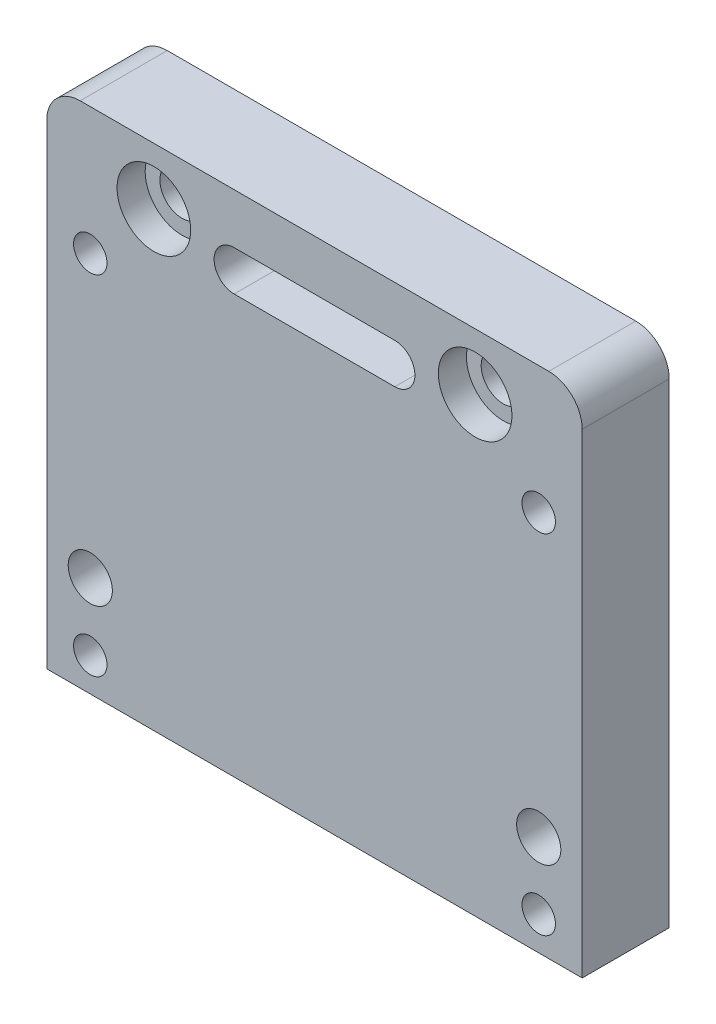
ISO-10303-21;
HEADER;
FILE_DESCRIPTION(('STEP AP214'),'2;1');
FILE_NAME('part.step','',(''),(''),'','','');
FILE_SCHEMA(('AUTOMOTIVE_DESIGN { 1 0 10303 214 1 1 1 1 }'));
ENDSEC;
DATA;
#1=APPLICATION_CONTEXT('core data for automotive mechanical design processes');
#2=APPLICATION_PROTOCOL_DEFINITION('international standard','automotive_design',2000,#1);
#3=PRODUCT_CONTEXT('',#1,'mechanical');
#4=PRODUCT('Part','Part','',(#3));
#5=PRODUCT_RELATED_PRODUCT_CATEGORY('part','',(#4));
#6=PRODUCT_DEFINITION_FORMATION('','',#4);
#7=PRODUCT_DEFINITION_CONTEXT('part definition',#1,'design');
#8=PRODUCT_DEFINITION('design','',#6,#7);
#9=PRODUCT_DEFINITION_SHAPE('','',#8);
#10=(LENGTH_UNIT() NAMED_UNIT(*) SI_UNIT(.MILLI.,.METRE.));
#11=(NAMED_UNIT(*) PLANE_ANGLE_UNIT() SI_UNIT($,.RADIAN.));
#12=(NAMED_UNIT(*) SI_UNIT($,.STERADIAN.) SOLID_ANGLE_UNIT());
#13=UNCERTAINTY_MEASURE_WITH_UNIT(LENGTH_MEASURE(1.E-05),#10,'distance_accuracy_value','');
#14=(GEOMETRIC_REPRESENTATION_CONTEXT(3) GLOBAL_UNCERTAINTY_ASSIGNED_CONTEXT((#13)) GLOBAL_UNIT_ASSIGNED_CONTEXT((#10,
#11,#12)) REPRESENTATION_CONTEXT('',''));
#15=CARTESIAN_POINT('',(0.,0.,0.));
#16=DIRECTION('',(0.,0.,1.));
#17=DIRECTION('',(1.,0.,0.));
#18=AXIS2_PLACEMENT_3D('',#15,#16,#17);
#19=CARTESIAN_POINT('',(-40.,0.,0.));
#20=DIRECTION('',(0.,0.,-1.));
#21=DIRECTION('',(-1.,0.,0.));
#22=AXIS2_PLACEMENT_3D('',#19,#20,#21);
#23=PLANE('',#22);
#24=CARTESIAN_POINT('',(-33.5,57.,0.));
#25=DIRECTION('',(0.,0.,1.));
#26=DIRECTION('',(1.,0.,0.));
#27=AXIS2_PLACEMENT_3D('',#24,#25,#26);
#28=CIRCLE('',#27,2.5);
#29=CARTESIAN_POINT('',(-31.,57.,0.));
#30=VERTEX_POINT('',#29);
#31=EDGE_CURVE('E556',#30,#30,#28,.T.);
#32=ORIENTED_EDGE('',*,*,#31,.T.);
#33=EDGE_LOOP('',(#32));
#34=FACE_BOUND('',#33,.T.);
#35=CARTESIAN_POINT('',(-33.5,5.,0.));
#36=DIRECTION('',(0.,0.,1.));
#37=DIRECTION('',(1.,0.,0.));
#38=AXIS2_PLACEMENT_3D('',#35,#36,#37);
#39=CIRCLE('',#38,2.5);
#40=CARTESIAN_POINT('',(-31.,5.,0.));
#41=VERTEX_POINT('',#40);
#42=EDGE_CURVE('E560',#41,#41,#39,.T.);
#43=ORIENTED_EDGE('',*,*,#42,.T.);
#44=EDGE_LOOP('',(#43));
#45=FACE_BOUND('',#44,.T.);
#46=CARTESIAN_POINT('',(33.5,5.,0.));
#47=DIRECTION('',(0.,0.,1.));
#48=DIRECTION('',(1.,0.,0.));
#49=AXIS2_PLACEMENT_3D('',#46,#47,#48);
#50=CIRCLE('',#49,2.5);
#51=CARTESIAN_POINT('',(36.,5.,0.));
#52=VERTEX_POINT('',#51);
#53=EDGE_CURVE('E569',#52,#52,#50,.T.);
#54=ORIENTED_EDGE('',*,*,#53,.T.);
#55=EDGE_LOOP('',(#54));
#56=FACE_BOUND('',#55,.T.);
#57=DIRECTION('',(-1.,0.,0.));
#58=VECTOR('',#57,1.);
#59=CARTESIAN_POINT('',(-40.,76.,0.));
#60=LINE('',#59,#58);
#61=CARTESIAN_POINT('',(35.,76.,0.));
#62=VERTEX_POINT('',#61);
#63=CARTESIAN_POINT('',(-35.,76.,0.));
#64=VERTEX_POINT('',#63);
#65=EDGE_CURVE('E208',#62,#64,#60,.T.);
#66=ORIENTED_EDGE('',*,*,#65,.F.);
#67=CARTESIAN_POINT('',(35.,71.,0.));
#68=DIRECTION('',(0.,0.,-1.));
#69=DIRECTION('',(-1.,0.,0.));
#70=AXIS2_PLACEMENT_3D('',#67,#68,#69);
#71=CIRCLE('',#70,5.);
#72=CARTESIAN_POINT('',(40.,71.,0.));
#73=VERTEX_POINT('',#72);
#74=EDGE_CURVE('E237',#62,#73,#71,.T.);
#75=ORIENTED_EDGE('',*,*,#74,.T.);
#76=DIRECTION('',(0.,1.,0.));
#77=VECTOR('',#76,1.);
#78=CARTESIAN_POINT('',(40.,0.,0.));
#79=LINE('',#78,#77);
#80=CARTESIAN_POINT('',(40.,0.,0.));
#81=VERTEX_POINT('',#80);
#82=EDGE_CURVE('E220',#81,#73,#79,.T.);
#83=ORIENTED_EDGE('',*,*,#82,.F.);
#84=DIRECTION('',(1.,0.,0.));
#85=VECTOR('',#84,1.);
#86=CARTESIAN_POINT('',(-40.,0.,0.));
#87=LINE('',#86,#85);
#88=CARTESIAN_POINT('',(-40.,0.,0.));
#89=VERTEX_POINT('',#88);
#90=EDGE_CURVE('E218',#89,#81,#87,.T.);
#91=ORIENTED_EDGE('',*,*,#90,.F.);
#92=DIRECTION('',(0.,-1.,0.));
#93=VECTOR('',#92,1.);
#94=CARTESIAN_POINT('',(-40.,0.,0.));
#95=LINE('',#94,#93);
#96=CARTESIAN_POINT('',(-40.,71.,0.));
#97=VERTEX_POINT('',#96);
#98=EDGE_CURVE('E204',#97,#89,#95,.T.);
#99=ORIENTED_EDGE('',*,*,#98,.F.);
#100=CARTESIAN_POINT('',(-35.,71.,0.));
#101=DIRECTION('',(0.,0.,-1.));
#102=DIRECTION('',(-1.,0.,0.));
#103=AXIS2_PLACEMENT_3D('',#100,#101,#102);
#104=CIRCLE('',#103,5.);
#105=EDGE_CURVE('E235',#97,#64,#104,.T.);
#106=ORIENTED_EDGE('',*,*,#105,.T.);
#107=EDGE_LOOP('',(#66,#75,#83,#91,#99,#106));
#108=FACE_BOUND('',#107,.T.);
#109=CARTESIAN_POINT('',(33.5,15.,0.));
#110=DIRECTION('',(0.,0.,-1.));
#111=DIRECTION('',(-1.,0.,0.));
#112=AXIS2_PLACEMENT_3D('',#109,#110,#111);
#113=CIRCLE('',#112,5.49999999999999);
#114=CARTESIAN_POINT('',(28.,15.,0.));
#115=VERTEX_POINT('',#114);
#116=EDGE_CURVE('E192',#115,#115,#113,.T.);
#117=ORIENTED_EDGE('',*,*,#116,.F.);
#118=EDGE_LOOP('',(#117));
#119=FACE_BOUND('',#118,.T.);
#120=CARTESIAN_POINT('',(-33.5,15.,0.));
#121=DIRECTION('',(0.,0.,-1.));
#122=DIRECTION('',(-1.,0.,0.));
#123=AXIS2_PLACEMENT_3D('',#120,#121,#122);
#124=CIRCLE('',#123,5.49999999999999);
#125=CARTESIAN_POINT('',(-39.,15.,0.));
#126=VERTEX_POINT('',#125);
#127=EDGE_CURVE('E180',#126,#126,#124,.T.);
#128=ORIENTED_EDGE('',*,*,#127,.F.);
#129=EDGE_LOOP('',(#128));
#130=FACE_BOUND('',#129,.T.);
#131=CARTESIAN_POINT('',(24.,67.5,0.));
#132=DIRECTION('',(0.,0.,-1.));
#133=DIRECTION('',(-1.,0.,0.));
#134=AXIS2_PLACEMENT_3D('',#131,#132,#133);
#135=CIRCLE('',#134,5.49999999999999);
#136=CARTESIAN_POINT('',(18.5,67.5,0.));
#137=VERTEX_POINT('',#136);
#138=EDGE_CURVE('E171',#137,#137,#135,.T.);
#139=ORIENTED_EDGE('',*,*,#138,.F.);
#140=EDGE_LOOP('',(#139));
#141=FACE_BOUND('',#140,.T.);
#142=CARTESIAN_POINT('',(-24.,67.5,0.));
#143=DIRECTION('',(0.,0.,-1.));
#144=DIRECTION('',(-1.,0.,0.));
#145=AXIS2_PLACEMENT_3D('',#142,#143,#144);
#146=CIRCLE('',#145,5.49999999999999);
#147=CARTESIAN_POINT('',(-29.5,67.5,0.));
#148=VERTEX_POINT('',#147);
#149=EDGE_CURVE('E162',#148,#148,#146,.T.);
#150=ORIENTED_EDGE('',*,*,#149,.F.);
#151=EDGE_LOOP('',(#150));
#152=FACE_BOUND('',#151,.T.);
#153=CARTESIAN_POINT('',(-12.,65.5,0.));
#154=DIRECTION('',(0.,0.,1.));
#155=DIRECTION('',(-1.,0.,0.));
#156=AXIS2_PLACEMENT_3D('',#153,#154,#155);
#157=CIRCLE('',#156,3.);
#158=CARTESIAN_POINT('',(-12.,68.5,0.));
#159=VERTEX_POINT('',#158);
#160=CARTESIAN_POINT('',(-12.,62.5,0.));
#161=VERTEX_POINT('',#160);
#162=EDGE_CURVE('E113',#159,#161,#157,.T.);
#163=ORIENTED_EDGE('',*,*,#162,.T.);
#164=DIRECTION('',(1.,0.,0.));
#165=VECTOR('',#164,1.);
#166=CARTESIAN_POINT('',(-12.,62.5,0.));
#167=LINE('',#166,#165);
#168=CARTESIAN_POINT('',(12.,62.5,0.));
#169=VERTEX_POINT('',#168);
#170=EDGE_CURVE('E122',#161,#169,#167,.T.);
#171=ORIENTED_EDGE('',*,*,#170,.T.);
#172=CARTESIAN_POINT('',(12.,65.5,0.));
#173=DIRECTION('',(0.,0.,1.));
#174=DIRECTION('',(1.,0.,0.));
#175=AXIS2_PLACEMENT_3D('',#172,#173,#174);
#176=CIRCLE('',#175,3.);
#177=CARTESIAN_POINT('',(12.,68.5,0.));
#178=VERTEX_POINT('',#177);
#179=EDGE_CURVE('E57',#169,#178,#176,.T.);
#180=ORIENTED_EDGE('',*,*,#179,.T.);
#181=DIRECTION('',(-1.,0.,0.));
#182=VECTOR('',#181,1.);
#183=CARTESIAN_POINT('',(-12.,68.5,0.));
#184=LINE('',#183,#182);
#185=EDGE_CURVE('E119',#178,#159,#184,.T.);
#186=ORIENTED_EDGE('',*,*,#185,.T.);
#187=EDGE_LOOP('',(#163,#171,#180,#186));
#188=FACE_BOUND('',#187,.T.);
#189=CARTESIAN_POINT('',(33.5,57.,0.));
#190=DIRECTION('',(0.,0.,1.));
#191=DIRECTION('',(1.,0.,0.));
#192=AXIS2_PLACEMENT_3D('',#189,#190,#191);
#193=CIRCLE('',#192,2.5);
#194=CARTESIAN_POINT('',(36.,57.,0.));
#195=VERTEX_POINT('',#194);
#196=EDGE_CURVE('E574',#195,#195,#193,.T.);
#197=ORIENTED_EDGE('',*,*,#196,.T.);
#198=EDGE_LOOP('',(#197));
#199=FACE_BOUND('',#198,.T.);
#200=ADVANCED_FACE('F32',(#34,#45,#56,#108,#119,#130,#141,#152,#188,#199),#23,.T.);
#201=CARTESIAN_POINT('',(-40.,0.,13.));
#202=DIRECTION('',(0.,0.,-1.));
#203=DIRECTION('',(-1.,0.,0.));
#204=AXIS2_PLACEMENT_3D('',#201,#202,#203);
#205=PLANE('',#204);
#206=CARTESIAN_POINT('',(-33.5,57.,13.));
#207=DIRECTION('',(0.,0.,1.));
#208=DIRECTION('',(1.,0.,0.));
#209=AXIS2_PLACEMENT_3D('',#206,#207,#208);
#210=CIRCLE('',#209,2.49999999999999);
#211=CARTESIAN_POINT('',(-31.,57.,13.));
#212=VERTEX_POINT('',#211);
#213=EDGE_CURVE('E559',#212,#212,#210,.T.);
#214=ORIENTED_EDGE('',*,*,#213,.F.);
#215=EDGE_LOOP('',(#214));
#216=FACE_BOUND('',#215,.T.);
#217=CARTESIAN_POINT('',(-33.5,5.,13.));
#218=DIRECTION('',(0.,0.,1.));
#219=DIRECTION('',(1.,0.,0.));
#220=AXIS2_PLACEMENT_3D('',#217,#218,#219);
#221=CIRCLE('',#220,2.49999999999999);
#222=CARTESIAN_POINT('',(-31.,5.,13.));
#223=VERTEX_POINT('',#222);
#224=EDGE_CURVE('E563',#223,#223,#221,.T.);
#225=ORIENTED_EDGE('',*,*,#224,.F.);
#226=EDGE_LOOP('',(#225));
#227=FACE_BOUND('',#226,.T.);
#228=CARTESIAN_POINT('',(33.5,5.,13.));
#229=DIRECTION('',(0.,0.,1.));
#230=DIRECTION('',(1.,0.,0.));
#231=AXIS2_PLACEMENT_3D('',#228,#229,#230);
#232=CIRCLE('',#231,2.49999999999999);
#233=CARTESIAN_POINT('',(36.,5.,13.));
#234=VERTEX_POINT('',#233);
#235=EDGE_CURVE('E572',#234,#234,#232,.T.);
#236=ORIENTED_EDGE('',*,*,#235,.F.);
#237=EDGE_LOOP('',(#236));
#238=FACE_BOUND('',#237,.T.);
#239=CARTESIAN_POINT('',(33.5,57.,13.));
#240=DIRECTION('',(0.,0.,1.));
#241=DIRECTION('',(1.,0.,0.));
#242=AXIS2_PLACEMENT_3D('',#239,#240,#241);
#243=CIRCLE('',#242,2.49999999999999);
#244=CARTESIAN_POINT('',(36.,57.,13.));
#245=VERTEX_POINT('',#244);
#246=EDGE_CURVE('E134',#245,#245,#243,.T.);
#247=ORIENTED_EDGE('',*,*,#246,.F.);
#248=EDGE_LOOP('',(#247));
#249=FACE_BOUND('',#248,.T.);
#250=DIRECTION('',(1.,0.,0.));
#251=VECTOR('',#250,1.);
#252=CARTESIAN_POINT('',(-12.,62.5,13.));
#253=LINE('',#252,#251);
#254=CARTESIAN_POINT('',(-12.,62.5,13.));
#255=VERTEX_POINT('',#254);
#256=CARTESIAN_POINT('',(12.,62.5,13.));
#257=VERTEX_POINT('',#256);
#258=EDGE_CURVE('E140',#255,#257,#253,.T.);
#259=ORIENTED_EDGE('',*,*,#258,.F.);
#260=CARTESIAN_POINT('',(-12.,65.5,13.));
#261=DIRECTION('',(0.,0.,1.));
#262=DIRECTION('',(-1.,0.,0.));
#263=AXIS2_PLACEMENT_3D('',#260,#261,#262);
#264=CIRCLE('',#263,3.);
#265=CARTESIAN_POINT('',(-12.,68.5,13.));
#266=VERTEX_POINT('',#265);
#267=EDGE_CURVE('E49',#266,#255,#264,.T.);
#268=ORIENTED_EDGE('',*,*,#267,.F.);
#269=DIRECTION('',(-1.,0.,0.));
#270=VECTOR('',#269,1.);
#271=CARTESIAN_POINT('',(-12.,68.5,13.));
#272=LINE('',#271,#270);
#273=CARTESIAN_POINT('',(12.,68.5,13.));
#274=VERTEX_POINT('',#273);
#275=EDGE_CURVE('E128',#274,#266,#272,.T.);
#276=ORIENTED_EDGE('',*,*,#275,.F.);
#277=CARTESIAN_POINT('',(12.,65.5,13.));
#278=DIRECTION('',(0.,0.,1.));
#279=DIRECTION('',(1.,0.,0.));
#280=AXIS2_PLACEMENT_3D('',#277,#278,#279);
#281=CIRCLE('',#280,3.);
#282=EDGE_CURVE('E131',#257,#274,#281,.T.);
#283=ORIENTED_EDGE('',*,*,#282,.F.);
#284=EDGE_LOOP('',(#259,#268,#276,#283));
#285=FACE_BOUND('',#284,.T.);
#286=CARTESIAN_POINT('',(-24.,67.5,13.));
#287=DIRECTION('',(0.,0.,-1.));
#288=DIRECTION('',(-1.,0.,0.));
#289=AXIS2_PLACEMENT_3D('',#286,#287,#288);
#290=CIRCLE('',#289,5.5);
#291=CARTESIAN_POINT('',(-29.5,67.5,13.));
#292=VERTEX_POINT('',#291);
#293=EDGE_CURVE('E159',#292,#292,#290,.T.);
#294=ORIENTED_EDGE('',*,*,#293,.T.);
#295=EDGE_LOOP('',(#294));
#296=FACE_BOUND('',#295,.T.);
#297=CARTESIAN_POINT('',(-33.5,15.,13.));
#298=DIRECTION('',(0.,0.,-1.));
#299=DIRECTION('',(-1.,0.,0.));
#300=AXIS2_PLACEMENT_3D('',#297,#298,#299);
#301=CIRCLE('',#300,3.3);
#302=CARTESIAN_POINT('',(-36.8,15.,13.));
#303=VERTEX_POINT('',#302);
#304=EDGE_CURVE('E189',#303,#303,#301,.T.);
#305=ORIENTED_EDGE('',*,*,#304,.T.);
#306=EDGE_LOOP('',(#305));
#307=FACE_BOUND('',#306,.T.);
#308=CARTESIAN_POINT('',(33.5,15.,13.));
#309=DIRECTION('',(0.,0.,-1.));
#310=DIRECTION('',(-1.,0.,0.));
#311=AXIS2_PLACEMENT_3D('',#308,#309,#310);
#312=CIRCLE('',#311,3.3);
#313=CARTESIAN_POINT('',(30.2,15.,13.));
#314=VERTEX_POINT('',#313);
#315=EDGE_CURVE('E201',#314,#314,#312,.T.);
#316=ORIENTED_EDGE('',*,*,#315,.T.);
#317=EDGE_LOOP('',(#316));
#318=FACE_BOUND('',#317,.T.);
#319=DIRECTION('',(0.,1.,0.));
#320=VECTOR('',#319,1.);
#321=CARTESIAN_POINT('',(40.,0.,13.));
#322=LINE('',#321,#320);
#323=CARTESIAN_POINT('',(40.,0.,13.));
#324=VERTEX_POINT('',#323);
#325=CARTESIAN_POINT('',(40.,71.,13.));
#326=VERTEX_POINT('',#325);
#327=EDGE_CURVE('E210',#324,#326,#322,.T.);
#328=ORIENTED_EDGE('',*,*,#327,.T.);
#329=CARTESIAN_POINT('',(35.,71.,13.));
#330=DIRECTION('',(0.,0.,-1.));
#331=DIRECTION('',(-1.,0.,0.));
#332=AXIS2_PLACEMENT_3D('',#329,#330,#331);
#333=CIRCLE('',#332,5.);
#334=CARTESIAN_POINT('',(35.,76.,13.));
#335=VERTEX_POINT('',#334);
#336=EDGE_CURVE('E41',#326,#335,#333,.F.);
#337=ORIENTED_EDGE('',*,*,#336,.T.);
#338=DIRECTION('',(-1.,0.,0.));
#339=VECTOR('',#338,1.);
#340=CARTESIAN_POINT('',(-40.,76.,13.));
#341=LINE('',#340,#339);
#342=CARTESIAN_POINT('',(-35.,76.,13.));
#343=VERTEX_POINT('',#342);
#344=EDGE_CURVE('E213',#335,#343,#341,.T.);
#345=ORIENTED_EDGE('',*,*,#344,.T.);
#346=CARTESIAN_POINT('',(-35.,71.,13.));
#347=DIRECTION('',(0.,0.,-1.));
#348=DIRECTION('',(-1.,0.,0.));
#349=AXIS2_PLACEMENT_3D('',#346,#347,#348);
#350=CIRCLE('',#349,5.);
#351=CARTESIAN_POINT('',(-40.,71.,13.));
#352=VERTEX_POINT('',#351);
#353=EDGE_CURVE('E241',#343,#352,#350,.F.);
#354=ORIENTED_EDGE('',*,*,#353,.T.);
#355=DIRECTION('',(0.,-1.,0.));
#356=VECTOR('',#355,1.);
#357=CARTESIAN_POINT('',(-40.,0.,13.));
#358=LINE('',#357,#356);
#359=CARTESIAN_POINT('',(-40.,0.,13.));
#360=VERTEX_POINT('',#359);
#361=EDGE_CURVE('E205',#352,#360,#358,.T.);
#362=ORIENTED_EDGE('',*,*,#361,.T.);
#363=DIRECTION('',(1.,0.,0.));
#364=VECTOR('',#363,1.);
#365=CARTESIAN_POINT('',(-40.,0.,13.));
#366=LINE('',#365,#364);
#367=EDGE_CURVE('E207',#360,#324,#366,.T.);
#368=ORIENTED_EDGE('',*,*,#367,.T.);
#369=EDGE_LOOP('',(#328,#337,#345,#354,#362,#368));
#370=FACE_BOUND('',#369,.T.);
#371=CARTESIAN_POINT('',(24.,67.5,13.));
#372=DIRECTION('',(0.,0.,-1.));
#373=DIRECTION('',(1.,0.,0.));
#374=AXIS2_PLACEMENT_3D('',#371,#372,#373);
#375=CIRCLE('',#374,5.5);
#376=CARTESIAN_POINT('',(29.5,67.5,13.));
#377=VERTEX_POINT('',#376);
#378=EDGE_CURVE('E146',#377,#377,#375,.T.);
#379=ORIENTED_EDGE('',*,*,#378,.T.);
#380=EDGE_LOOP('',(#379));
#381=FACE_BOUND('',#380,.T.);
#382=ADVANCED_FACE('F268',(#216,#227,#238,#249,#285,#296,#307,#318,#370,#381),#205,.F.);
#383=CARTESIAN_POINT('',(24.,67.5,0.));
#384=DIRECTION('',(0.,0.,-1.));
#385=DIRECTION('',(-1.,0.,0.));
#386=AXIS2_PLACEMENT_3D('',#383,#384,#385);
#387=CYLINDRICAL_SURFACE('',#386,3.3);
#388=CARTESIAN_POINT('',(24.,67.5,4.2));
#389=DIRECTION('',(0.,0.,-1.));
#390=DIRECTION('',(-1.,0.,0.));
#391=AXIS2_PLACEMENT_3D('',#388,#389,#390);
#392=CIRCLE('',#391,3.3);
#393=CARTESIAN_POINT('',(20.7,67.5,4.2));
#394=VERTEX_POINT('',#393);
#395=EDGE_CURVE('E177',#394,#394,#392,.T.);
#396=ORIENTED_EDGE('',*,*,#395,.T.);
#397=EDGE_LOOP('',(#396));
#398=FACE_BOUND('',#397,.T.);
#399=CARTESIAN_POINT('',(24.,67.5,8.8));
#400=DIRECTION('',(0.,0.,1.));
#401=DIRECTION('',(1.,0.,0.));
#402=AXIS2_PLACEMENT_3D('',#399,#400,#401);
#403=CIRCLE('',#402,3.3);
#404=CARTESIAN_POINT('',(27.3,67.5,8.8));
#405=VERTEX_POINT('',#404);
#406=EDGE_CURVE('E36',#405,#405,#403,.F.);
#407=ORIENTED_EDGE('',*,*,#406,.F.);
#408=EDGE_LOOP('',(#407));
#409=FACE_BOUND('',#408,.T.);
#410=ADVANCED_FACE('F274',(#398,#409),#387,.F.);
#411=CARTESIAN_POINT('',(-40.,0.,13.));
#412=DIRECTION('',(1.,0.,0.));
#413=DIRECTION('',(0.,0.,-1.));
#414=AXIS2_PLACEMENT_3D('',#411,#412,#413);
#415=PLANE('',#414);
#416=ORIENTED_EDGE('',*,*,#361,.F.);
#417=DIRECTION('',(0.,0.,-1.));
#418=VECTOR('',#417,1.);
#419=CARTESIAN_POINT('',(-40.,71.,13.));
#420=LINE('',#419,#418);
#421=EDGE_CURVE('E11',#352,#97,#420,.T.);
#422=ORIENTED_EDGE('',*,*,#421,.T.);
#423=ORIENTED_EDGE('',*,*,#98,.T.);
#424=DIRECTION('',(0.,0.,-1.));
#425=VECTOR('',#424,1.);
#426=CARTESIAN_POINT('',(-40.,0.,13.));
#427=LINE('',#426,#425);
#428=EDGE_CURVE('E227',#360,#89,#427,.T.);
#429=ORIENTED_EDGE('',*,*,#428,.F.);
#430=EDGE_LOOP('',(#416,#422,#423,#429));
#431=FACE_BOUND('',#430,.T.);
#432=ADVANCED_FACE('F293',(#431),#415,.F.);
#433=CARTESIAN_POINT('',(-40.,0.,13.));
#434=DIRECTION('',(0.,1.,0.));
#435=DIRECTION('',(0.,0.,1.));
#436=AXIS2_PLACEMENT_3D('',#433,#434,#435);
#437=PLANE('',#436);
#438=ORIENTED_EDGE('',*,*,#90,.T.);
#439=DIRECTION('',(0.,0.,-1.));
#440=VECTOR('',#439,1.);
#441=CARTESIAN_POINT('',(40.,0.,13.));
#442=LINE('',#441,#440);
#443=EDGE_CURVE('E216',#324,#81,#442,.T.);
#444=ORIENTED_EDGE('',*,*,#443,.F.);
#445=ORIENTED_EDGE('',*,*,#367,.F.);
#446=ORIENTED_EDGE('',*,*,#428,.T.);
#447=EDGE_LOOP('',(#438,#444,#445,#446));
#448=FACE_BOUND('',#447,.T.);
#449=ADVANCED_FACE('F289',(#448),#437,.F.);
#450=CARTESIAN_POINT('',(40.,0.,13.));
#451=DIRECTION('',(-1.,0.,0.));
#452=DIRECTION('',(0.,0.,1.));
#453=AXIS2_PLACEMENT_3D('',#450,#451,#452);
#454=PLANE('',#453);
#455=ORIENTED_EDGE('',*,*,#82,.T.);
#456=DIRECTION('',(0.,0.,-1.));
#457=VECTOR('',#456,1.);
#458=CARTESIAN_POINT('',(40.,71.,13.));
#459=LINE('',#458,#457);
#460=EDGE_CURVE('E239',#73,#326,#459,.F.);
#461=ORIENTED_EDGE('',*,*,#460,.T.);
#462=ORIENTED_EDGE('',*,*,#327,.F.);
#463=ORIENTED_EDGE('',*,*,#443,.T.);
#464=EDGE_LOOP('',(#455,#461,#462,#463));
#465=FACE_BOUND('',#464,.T.);
#466=ADVANCED_FACE('F285',(#465),#454,.F.);
#467=CARTESIAN_POINT('',(-40.,76.,13.));
#468=DIRECTION('',(0.,-1.,0.));
#469=DIRECTION('',(1.,0.,0.));
#470=AXIS2_PLACEMENT_3D('',#467,#468,#469);
#471=PLANE('',#470);
#472=ORIENTED_EDGE('',*,*,#344,.F.);
#473=DIRECTION('',(0.,0.,-1.));
#474=VECTOR('',#473,1.);
#475=CARTESIAN_POINT('',(35.,76.,13.));
#476=LINE('',#475,#474);
#477=EDGE_CURVE('E232',#335,#62,#476,.T.);
#478=ORIENTED_EDGE('',*,*,#477,.T.);
#479=ORIENTED_EDGE('',*,*,#65,.T.);
#480=DIRECTION('',(0.,0.,-1.));
#481=VECTOR('',#480,1.);
#482=CARTESIAN_POINT('',(-35.,76.,13.));
#483=LINE('',#482,#481);
#484=EDGE_CURVE('E230',#64,#343,#483,.F.);
#485=ORIENTED_EDGE('',*,*,#484,.T.);
#486=EDGE_LOOP('',(#472,#478,#479,#485));
#487=FACE_BOUND('',#486,.T.);
#488=ADVANCED_FACE('F281',(#487),#471,.F.);
#489=CARTESIAN_POINT('',(35.,71.,13.));
#490=DIRECTION('',(0.,0.,-1.));
#491=DIRECTION('',(-1.,0.,0.));
#492=AXIS2_PLACEMENT_3D('',#489,#490,#491);
#493=CYLINDRICAL_SURFACE('',#492,5.);
#494=ORIENTED_EDGE('',*,*,#336,.F.);
#495=ORIENTED_EDGE('',*,*,#460,.F.);
#496=ORIENTED_EDGE('',*,*,#74,.F.);
#497=ORIENTED_EDGE('',*,*,#477,.F.);
#498=EDGE_LOOP('',(#494,#495,#496,#497));
#499=FACE_BOUND('',#498,.T.);
#500=ADVANCED_FACE('F284',(#499),#493,.T.);
#501=CARTESIAN_POINT('',(-35.,71.,13.));
#502=DIRECTION('',(0.,0.,-1.));
#503=DIRECTION('',(-1.,0.,0.));
#504=AXIS2_PLACEMENT_3D('',#501,#502,#503);
#505=CYLINDRICAL_SURFACE('',#504,5.);
#506=ORIENTED_EDGE('',*,*,#353,.F.);
#507=ORIENTED_EDGE('',*,*,#484,.F.);
#508=ORIENTED_EDGE('',*,*,#105,.F.);
#509=ORIENTED_EDGE('',*,*,#421,.F.);
#510=EDGE_LOOP('',(#506,#507,#508,#509));
#511=FACE_BOUND('',#510,.T.);
#512=ADVANCED_FACE('F34',(#511),#505,.T.);
#513=CARTESIAN_POINT('',(33.5,15.,0.));
#514=DIRECTION('',(0.,0.,-1.));
#515=DIRECTION('',(-1.,0.,0.));
#516=AXIS2_PLACEMENT_3D('',#513,#514,#515);
#517=CYLINDRICAL_SURFACE('',#516,3.3);
#518=ORIENTED_EDGE('',*,*,#315,.F.);
#519=EDGE_LOOP('',(#518));
#520=FACE_BOUND('',#519,.T.);
#521=CARTESIAN_POINT('',(33.5,15.,4.2));
#522=DIRECTION('',(0.,0.,-1.));
#523=DIRECTION('',(-1.,0.,0.));
#524=AXIS2_PLACEMENT_3D('',#521,#522,#523);
#525=CIRCLE('',#524,3.3);
#526=CARTESIAN_POINT('',(30.2,15.,4.2));
#527=VERTEX_POINT('',#526);
#528=EDGE_CURVE('E198',#527,#527,#525,.T.);
#529=ORIENTED_EDGE('',*,*,#528,.T.);
#530=EDGE_LOOP('',(#529));
#531=FACE_BOUND('',#530,.T.);
#532=ADVANCED_FACE('F302',(#520,#531),#517,.F.);
#533=CARTESIAN_POINT('',(36.8,15.,4.2));
#534=DIRECTION('',(0.,0.,1.));
#535=DIRECTION('',(1.,0.,0.));
#536=AXIS2_PLACEMENT_3D('',#533,#534,#535);
#537=PLANE('',#536);
#538=ORIENTED_EDGE('',*,*,#528,.F.);
#539=EDGE_LOOP('',(#538));
#540=FACE_BOUND('',#539,.T.);
#541=CARTESIAN_POINT('',(33.5,15.,4.2));
#542=DIRECTION('',(0.,0.,-1.));
#543=DIRECTION('',(-1.,0.,0.));
#544=AXIS2_PLACEMENT_3D('',#541,#542,#543);
#545=CIRCLE('',#544,5.5);
#546=CARTESIAN_POINT('',(28.,15.,4.2));
#547=VERTEX_POINT('',#546);
#548=EDGE_CURVE('E195',#547,#547,#545,.T.);
#549=ORIENTED_EDGE('',*,*,#548,.T.);
#550=EDGE_LOOP('',(#549));
#551=FACE_BOUND('',#550,.T.);
#552=ADVANCED_FACE('F366',(#540,#551),#537,.F.);
#553=CARTESIAN_POINT('',(33.5,15.,0.));
#554=DIRECTION('',(0.,0.,-1.));
#555=DIRECTION('',(-1.,0.,0.));
#556=AXIS2_PLACEMENT_3D('',#553,#554,#555);
#557=CYLINDRICAL_SURFACE('',#556,5.49999999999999);
#558=ORIENTED_EDGE('',*,*,#548,.F.);
#559=EDGE_LOOP('',(#558));
#560=FACE_BOUND('',#559,.T.);
#561=ORIENTED_EDGE('',*,*,#116,.T.);
#562=EDGE_LOOP('',(#561));
#563=FACE_BOUND('',#562,.T.);
#564=ADVANCED_FACE('F362',(#560,#563),#557,.F.);
#565=CARTESIAN_POINT('',(-33.5,15.,0.));
#566=DIRECTION('',(0.,0.,-1.));
#567=DIRECTION('',(-1.,0.,0.));
#568=AXIS2_PLACEMENT_3D('',#565,#566,#567);
#569=CYLINDRICAL_SURFACE('',#568,3.3);
#570=ORIENTED_EDGE('',*,*,#304,.F.);
#571=EDGE_LOOP('',(#570));
#572=FACE_BOUND('',#571,.T.);
#573=CARTESIAN_POINT('',(-33.5,15.,4.2));
#574=DIRECTION('',(0.,0.,-1.));
#575=DIRECTION('',(-1.,0.,0.));
#576=AXIS2_PLACEMENT_3D('',#573,#574,#575);
#577=CIRCLE('',#576,3.3);
#578=CARTESIAN_POINT('',(-36.8,15.,4.2));
#579=VERTEX_POINT('',#578);
#580=EDGE_CURVE('E186',#579,#579,#577,.T.);
#581=ORIENTED_EDGE('',*,*,#580,.T.);
#582=EDGE_LOOP('',(#581));
#583=FACE_BOUND('',#582,.T.);
#584=ADVANCED_FACE('F358',(#572,#583),#569,.F.);
#585=CARTESIAN_POINT('',(-30.2,15.,4.2));
#586=DIRECTION('',(0.,0.,1.));
#587=DIRECTION('',(1.,0.,0.));
#588=AXIS2_PLACEMENT_3D('',#585,#586,#587);
#589=PLANE('',#588);
#590=ORIENTED_EDGE('',*,*,#580,.F.);
#591=EDGE_LOOP('',(#590));
#592=FACE_BOUND('',#591,.T.);
#593=CARTESIAN_POINT('',(-33.5,15.,4.2));
#594=DIRECTION('',(0.,0.,-1.));
#595=DIRECTION('',(-1.,0.,0.));
#596=AXIS2_PLACEMENT_3D('',#593,#594,#595);
#597=CIRCLE('',#596,5.5);
#598=CARTESIAN_POINT('',(-39.,15.,4.2));
#599=VERTEX_POINT('',#598);
#600=EDGE_CURVE('E183',#599,#599,#597,.T.);
#601=ORIENTED_EDGE('',*,*,#600,.T.);
#602=EDGE_LOOP('',(#601));
#603=FACE_BOUND('',#602,.T.);
#604=ADVANCED_FACE('F354',(#592,#603),#589,.F.);
#605=CARTESIAN_POINT('',(-33.5,15.,0.));
#606=DIRECTION('',(0.,0.,-1.));
#607=DIRECTION('',(-1.,0.,0.));
#608=AXIS2_PLACEMENT_3D('',#605,#606,#607);
#609=CYLINDRICAL_SURFACE('',#608,5.5);
#610=ORIENTED_EDGE('',*,*,#600,.F.);
#611=EDGE_LOOP('',(#610));
#612=FACE_BOUND('',#611,.T.);
#613=ORIENTED_EDGE('',*,*,#127,.T.);
#614=EDGE_LOOP('',(#613));
#615=FACE_BOUND('',#614,.T.);
#616=ADVANCED_FACE('F343',(#612,#615),#609,.F.);
#617=CARTESIAN_POINT('',(27.3,67.5,4.2));
#618=DIRECTION('',(0.,0.,1.));
#619=DIRECTION('',(1.,0.,0.));
#620=AXIS2_PLACEMENT_3D('',#617,#618,#619);
#621=PLANE('',#620);
#622=ORIENTED_EDGE('',*,*,#395,.F.);
#623=EDGE_LOOP('',(#622));
#624=FACE_BOUND('',#623,.T.);
#625=CARTESIAN_POINT('',(24.,67.5,4.2));
#626=DIRECTION('',(0.,0.,-1.));
#627=DIRECTION('',(-1.,0.,0.));
#628=AXIS2_PLACEMENT_3D('',#625,#626,#627);
#629=CIRCLE('',#628,5.5);
#630=CARTESIAN_POINT('',(18.5,67.5,4.2));
#631=VERTEX_POINT('',#630);
#632=EDGE_CURVE('E174',#631,#631,#629,.T.);
#633=ORIENTED_EDGE('',*,*,#632,.T.);
#634=EDGE_LOOP('',(#633));
#635=FACE_BOUND('',#634,.T.);
#636=ADVANCED_FACE('F335',(#624,#635),#621,.F.);
#637=CARTESIAN_POINT('',(24.,67.5,0.));
#638=DIRECTION('',(0.,0.,-1.));
#639=DIRECTION('',(-1.,0.,0.));
#640=AXIS2_PLACEMENT_3D('',#637,#638,#639);
#641=CYLINDRICAL_SURFACE('',#640,5.5);
#642=ORIENTED_EDGE('',*,*,#632,.F.);
#643=EDGE_LOOP('',(#642));
#644=FACE_BOUND('',#643,.T.);
#645=ORIENTED_EDGE('',*,*,#138,.T.);
#646=EDGE_LOOP('',(#645));
#647=FACE_BOUND('',#646,.T.);
#648=ADVANCED_FACE('F333',(#644,#647),#641,.F.);
#649=CARTESIAN_POINT('',(-24.,67.5,0.));
#650=DIRECTION('',(0.,0.,-1.));
#651=DIRECTION('',(-1.,0.,0.));
#652=AXIS2_PLACEMENT_3D('',#649,#650,#651);
#653=CYLINDRICAL_SURFACE('',#652,3.3);
#654=CARTESIAN_POINT('',(-24.,67.5,8.8));
#655=DIRECTION('',(0.,0.,-1.));
#656=DIRECTION('',(-1.,0.,0.));
#657=AXIS2_PLACEMENT_3D('',#654,#655,#656);
#658=CIRCLE('',#657,3.3);
#659=CARTESIAN_POINT('',(-27.3,67.5,8.8));
#660=VERTEX_POINT('',#659);
#661=EDGE_CURVE('E158',#660,#660,#658,.F.);
#662=ORIENTED_EDGE('',*,*,#661,.T.);
#663=EDGE_LOOP('',(#662));
#664=FACE_BOUND('',#663,.T.);
#665=CARTESIAN_POINT('',(-24.,67.5,4.2));
#666=DIRECTION('',(0.,0.,-1.));
#667=DIRECTION('',(-1.,0.,0.));
#668=AXIS2_PLACEMENT_3D('',#665,#666,#667);
#669=CIRCLE('',#668,3.3);
#670=CARTESIAN_POINT('',(-27.3,67.5,4.2));
#671=VERTEX_POINT('',#670);
#672=EDGE_CURVE('E168',#671,#671,#669,.T.);
#673=ORIENTED_EDGE('',*,*,#672,.T.);
#674=EDGE_LOOP('',(#673));
#675=FACE_BOUND('',#674,.T.);
#676=ADVANCED_FACE('F246',(#664,#675),#653,.F.);
#677=CARTESIAN_POINT('',(-20.7,67.5,4.2));
#678=DIRECTION('',(0.,0.,1.));
#679=DIRECTION('',(1.,0.,0.));
#680=AXIS2_PLACEMENT_3D('',#677,#678,#679);
#681=PLANE('',#680);
#682=ORIENTED_EDGE('',*,*,#672,.F.);
#683=EDGE_LOOP('',(#682));
#684=FACE_BOUND('',#683,.T.);
#685=CARTESIAN_POINT('',(-24.,67.5,4.2));
#686=DIRECTION('',(0.,0.,-1.));
#687=DIRECTION('',(-1.,0.,0.));
#688=AXIS2_PLACEMENT_3D('',#685,#686,#687);
#689=CIRCLE('',#688,5.5);
#690=CARTESIAN_POINT('',(-29.5,67.5,4.2));
#691=VERTEX_POINT('',#690);
#692=EDGE_CURVE('E165',#691,#691,#689,.T.);
#693=ORIENTED_EDGE('',*,*,#692,.T.);
#694=EDGE_LOOP('',(#693));
#695=FACE_BOUND('',#694,.T.);
#696=ADVANCED_FACE('F262',(#684,#695),#681,.F.);
#697=CARTESIAN_POINT('',(-24.,67.5,0.));
#698=DIRECTION('',(0.,0.,-1.));
#699=DIRECTION('',(-1.,0.,0.));
#700=AXIS2_PLACEMENT_3D('',#697,#698,#699);
#701=CYLINDRICAL_SURFACE('',#700,5.5);
#702=ORIENTED_EDGE('',*,*,#692,.F.);
#703=EDGE_LOOP('',(#702));
#704=FACE_BOUND('',#703,.T.);
#705=ORIENTED_EDGE('',*,*,#149,.T.);
#706=EDGE_LOOP('',(#705));
#707=FACE_BOUND('',#706,.T.);
#708=ADVANCED_FACE('F252',(#704,#707),#701,.F.);
#709=CARTESIAN_POINT('',(-24.,67.5,8.8));
#710=DIRECTION('',(0.,0.,-1.));
#711=DIRECTION('',(-1.,0.,0.));
#712=AXIS2_PLACEMENT_3D('',#709,#710,#711);
#713=PLANE('',#712);
#714=CARTESIAN_POINT('',(-24.,67.5,8.8));
#715=DIRECTION('',(0.,0.,-1.));
#716=DIRECTION('',(-1.,0.,0.));
#717=AXIS2_PLACEMENT_3D('',#714,#715,#716);
#718=CIRCLE('',#717,5.5);
#719=CARTESIAN_POINT('',(-29.5,67.5,8.8));
#720=VERTEX_POINT('',#719);
#721=EDGE_CURVE('E155',#720,#720,#718,.T.);
#722=ORIENTED_EDGE('',*,*,#721,.F.);
#723=EDGE_LOOP('',(#722));
#724=FACE_BOUND('',#723,.T.);
#725=ORIENTED_EDGE('',*,*,#661,.F.);
#726=EDGE_LOOP('',(#725));
#727=FACE_BOUND('',#726,.T.);
#728=ADVANCED_FACE('F249',(#724,#727),#713,.F.);
#729=CARTESIAN_POINT('',(-24.,67.5,8.8));
#730=DIRECTION('',(0.,0.,1.));
#731=DIRECTION('',(1.,0.,0.));
#732=AXIS2_PLACEMENT_3D('',#729,#730,#731);
#733=CYLINDRICAL_SURFACE('',#732,5.5);
#734=ORIENTED_EDGE('',*,*,#721,.T.);
#735=EDGE_LOOP('',(#734));
#736=FACE_BOUND('',#735,.T.);
#737=ORIENTED_EDGE('',*,*,#293,.F.);
#738=EDGE_LOOP('',(#737));
#739=FACE_BOUND('',#738,.T.);
#740=ADVANCED_FACE('F251',(#736,#739),#733,.F.);
#741=CARTESIAN_POINT('',(24.,67.5,8.8));
#742=DIRECTION('',(0.,0.,1.));
#743=DIRECTION('',(1.,0.,0.));
#744=AXIS2_PLACEMENT_3D('',#741,#742,#743);
#745=PLANE('',#744);
#746=CARTESIAN_POINT('',(24.,67.5,8.8));
#747=DIRECTION('',(0.,0.,-1.));
#748=DIRECTION('',(1.,0.,0.));
#749=AXIS2_PLACEMENT_3D('',#746,#747,#748);
#750=CIRCLE('',#749,5.5);
#751=CARTESIAN_POINT('',(29.5,67.5,8.8));
#752=VERTEX_POINT('',#751);
#753=EDGE_CURVE('E150',#752,#752,#750,.T.);
#754=ORIENTED_EDGE('',*,*,#753,.F.);
#755=EDGE_LOOP('',(#754));
#756=FACE_BOUND('',#755,.T.);
#757=ORIENTED_EDGE('',*,*,#406,.T.);
#758=EDGE_LOOP('',(#757));
#759=FACE_BOUND('',#758,.T.);
#760=ADVANCED_FACE('F259',(#756,#759),#745,.T.);
#761=CARTESIAN_POINT('',(24.,67.5,8.8));
#762=DIRECTION('',(0.,0.,1.));
#763=DIRECTION('',(1.,0.,0.));
#764=AXIS2_PLACEMENT_3D('',#761,#762,#763);
#765=CYLINDRICAL_SURFACE('',#764,5.5);
#766=ORIENTED_EDGE('',*,*,#753,.T.);
#767=EDGE_LOOP('',(#766));
#768=FACE_BOUND('',#767,.T.);
#769=ORIENTED_EDGE('',*,*,#378,.F.);
#770=EDGE_LOOP('',(#769));
#771=FACE_BOUND('',#770,.T.);
#772=ADVANCED_FACE('F457',(#768,#771),#765,.F.);
#773=CARTESIAN_POINT('',(-12.,65.5,0.));
#774=DIRECTION('',(0.,0.,1.));
#775=DIRECTION('',(1.,0.,0.));
#776=AXIS2_PLACEMENT_3D('',#773,#774,#775);
#777=CYLINDRICAL_SURFACE('',#776,3.);
#778=ORIENTED_EDGE('',*,*,#267,.T.);
#779=DIRECTION('',(0.,0.,1.));
#780=VECTOR('',#779,1.);
#781=CARTESIAN_POINT('',(-12.,62.5,0.));
#782=LINE('',#781,#780);
#783=EDGE_CURVE('E109',#161,#255,#782,.T.);
#784=ORIENTED_EDGE('',*,*,#783,.F.);
#785=ORIENTED_EDGE('',*,*,#162,.F.);
#786=DIRECTION('',(0.,0.,1.));
#787=VECTOR('',#786,1.);
#788=CARTESIAN_POINT('',(-12.,68.5,0.));
#789=LINE('',#788,#787);
#790=EDGE_CURVE('E144',#159,#266,#789,.T.);
#791=ORIENTED_EDGE('',*,*,#790,.T.);
#792=EDGE_LOOP('',(#778,#784,#785,#791));
#793=FACE_BOUND('',#792,.T.);
#794=ADVANCED_FACE('F111',(#793),#777,.F.);
#795=CARTESIAN_POINT('',(-12.,68.5,0.));
#796=DIRECTION('',(0.,1.,0.));
#797=DIRECTION('',(0.,0.,1.));
#798=AXIS2_PLACEMENT_3D('',#795,#796,#797);
#799=PLANE('',#798);
#800=ORIENTED_EDGE('',*,*,#275,.T.);
#801=ORIENTED_EDGE('',*,*,#790,.F.);
#802=ORIENTED_EDGE('',*,*,#185,.F.);
#803=DIRECTION('',(0.,0.,1.));
#804=VECTOR('',#803,1.);
#805=CARTESIAN_POINT('',(12.,68.5,0.));
#806=LINE('',#805,#804);
#807=EDGE_CURVE('E147',#178,#274,#806,.T.);
#808=ORIENTED_EDGE('',*,*,#807,.T.);
#809=EDGE_LOOP('',(#800,#801,#802,#808));
#810=FACE_BOUND('',#809,.T.);
#811=ADVANCED_FACE('F475',(#810),#799,.F.);
#812=CARTESIAN_POINT('',(12.,65.5,0.));
#813=DIRECTION('',(0.,0.,1.));
#814=DIRECTION('',(1.,0.,0.));
#815=AXIS2_PLACEMENT_3D('',#812,#813,#814);
#816=CYLINDRICAL_SURFACE('',#815,3.);
#817=ORIENTED_EDGE('',*,*,#282,.T.);
#818=ORIENTED_EDGE('',*,*,#807,.F.);
#819=ORIENTED_EDGE('',*,*,#179,.F.);
#820=DIRECTION('',(0.,0.,1.));
#821=VECTOR('',#820,1.);
#822=CARTESIAN_POINT('',(12.,62.5,0.));
#823=LINE('',#822,#821);
#824=EDGE_CURVE('E118',#169,#257,#823,.T.);
#825=ORIENTED_EDGE('',*,*,#824,.T.);
#826=EDGE_LOOP('',(#817,#818,#819,#825));
#827=FACE_BOUND('',#826,.T.);
#828=ADVANCED_FACE('F484',(#827),#816,.F.);
#829=CARTESIAN_POINT('',(-12.,62.5,0.));
#830=DIRECTION('',(0.,-1.,0.));
#831=DIRECTION('',(0.,0.,-1.));
#832=AXIS2_PLACEMENT_3D('',#829,#830,#831);
#833=PLANE('',#832);
#834=ORIENTED_EDGE('',*,*,#258,.T.);
#835=ORIENTED_EDGE('',*,*,#824,.F.);
#836=ORIENTED_EDGE('',*,*,#170,.F.);
#837=ORIENTED_EDGE('',*,*,#783,.T.);
#838=EDGE_LOOP('',(#834,#835,#836,#837));
#839=FACE_BOUND('',#838,.T.);
#840=ADVANCED_FACE('F123',(#839),#833,.F.);
#841=CARTESIAN_POINT('',(33.5,57.,13.));
#842=DIRECTION('',(0.,0.,1.));
#843=DIRECTION('',(1.,0.,0.));
#844=AXIS2_PLACEMENT_3D('',#841,#842,#843);
#845=CYLINDRICAL_SURFACE('',#844,2.49999999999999);
#846=ORIENTED_EDGE('',*,*,#196,.F.);
#847=EDGE_LOOP('',(#846));
#848=FACE_BOUND('',#847,.T.);
#849=ORIENTED_EDGE('',*,*,#246,.T.);
#850=EDGE_LOOP('',(#849));
#851=FACE_BOUND('',#850,.T.);
#852=ADVANCED_FACE('F501',(#848,#851),#845,.F.);
#853=CARTESIAN_POINT('',(33.5,5.,13.));
#854=DIRECTION('',(0.,0.,1.));
#855=DIRECTION('',(1.,0.,0.));
#856=AXIS2_PLACEMENT_3D('',#853,#854,#855);
#857=CYLINDRICAL_SURFACE('',#856,2.49999999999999);
#858=ORIENTED_EDGE('',*,*,#53,.F.);
#859=EDGE_LOOP('',(#858));
#860=FACE_BOUND('',#859,.T.);
#861=ORIENTED_EDGE('',*,*,#235,.T.);
#862=EDGE_LOOP('',(#861));
#863=FACE_BOUND('',#862,.T.);
#864=ADVANCED_FACE('F520',(#860,#863),#857,.F.);
#865=CARTESIAN_POINT('',(-33.5,5.,13.));
#866=DIRECTION('',(0.,0.,1.));
#867=DIRECTION('',(1.,0.,0.));
#868=AXIS2_PLACEMENT_3D('',#865,#866,#867);
#869=CYLINDRICAL_SURFACE('',#868,2.49999999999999);
#870=ORIENTED_EDGE('',*,*,#42,.F.);
#871=EDGE_LOOP('',(#870));
#872=FACE_BOUND('',#871,.T.);
#873=ORIENTED_EDGE('',*,*,#224,.T.);
#874=EDGE_LOOP('',(#873));
#875=FACE_BOUND('',#874,.T.);
#876=ADVANCED_FACE('F530',(#872,#875),#869,.F.);
#877=CARTESIAN_POINT('',(-33.5,57.,13.));
#878=DIRECTION('',(0.,0.,1.));
#879=DIRECTION('',(1.,0.,0.));
#880=AXIS2_PLACEMENT_3D('',#877,#878,#879);
#881=CYLINDRICAL_SURFACE('',#880,2.49999999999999);
#882=ORIENTED_EDGE('',*,*,#31,.F.);
#883=EDGE_LOOP('',(#882));
#884=FACE_BOUND('',#883,.T.);
#885=ORIENTED_EDGE('',*,*,#213,.T.);
#886=EDGE_LOOP('',(#885));
#887=FACE_BOUND('',#886,.T.);
#888=ADVANCED_FACE('F540',(#884,#887),#881,.F.);
#889=CLOSED_SHELL('',(#200,#382,#410,#432,#449,#466,#488,#500,#512,#532,#552,#564,#584,#604,
#616,#636,#648,#676,#696,#708,#728,#740,#760,#772,#794,#811,#828,#840,#852,#864,#876,#888));
#890=MANIFOLD_SOLID_BREP('B2',#889);
#891=ADVANCED_BREP_SHAPE_REPRESENTATION('',(#18,#890),#14);
#892=SHAPE_DEFINITION_REPRESENTATION(#9,#891);
ENDSEC;
END-ISO-10303-21;
